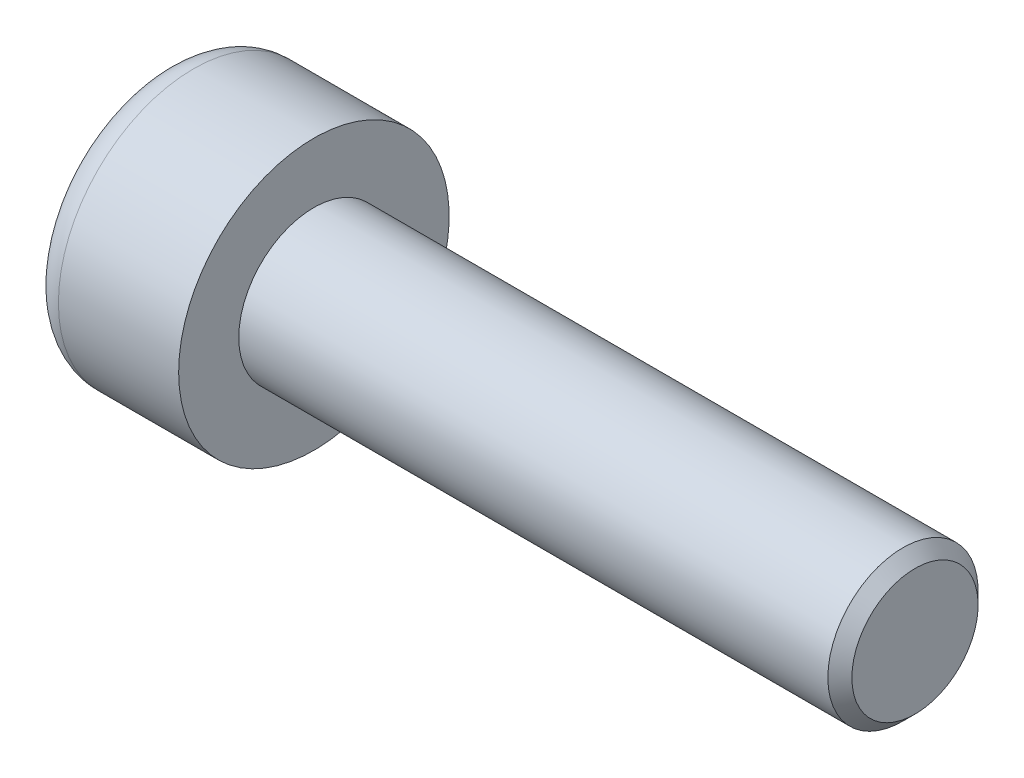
from build123d import *

# Parameters (mm, degrees)
CHANFREIN1_SIZE         = 0.2
CONG_1_R                = 0.5
EMPREINTE_POUR_CL_DEPTH = 2.5


with BuildPart() as part:
    # Esquisse1 → Base-R_volution (revolve)
    with BuildSketch(Plane.XY, mode=Mode.PRIVATE) as base_r_volution_sk:
        Polygon((-2.5, 0), (-2.5, 2.25), (0, 2.25), (0, 1.25), (10, 1.25), (10, 0), align=None)
    revolve(base_r_volution_sk.sketch.rotate(Axis((-28.982684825, 0, 0), (1, 0, 0)), 90), axis=Axis((-28.982684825, 0, 0), (1, 0, 0)))

    # Chanfrein1
    chanfrein1_edges = [part.edges().sort_by_distance(p)[0] for p in [
        (10, 0, -1.25),
    ]]
    chamfer(chanfrein1_edges, length=CHANFREIN1_SIZE)

    # Cong_1
    cong_1_edges = [part.edges().sort_by_distance(p)[0] for p in [
        (-2.5, 0, -2.25),
    ]]
    fillet(cong_1_edges, radius=CONG_1_R)

    # Esquisse2 → Empreinte pour cl (cut)
    with BuildSketch(Plane.ZY.offset(2.5)):
        Polygon((0.577350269, -1), (-0.577350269, -1), (-1.154700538, 0), (-0.577350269, 1), (0.577350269, 1), (1.154700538, 0), align=None)
    extrude(amount=-EMPREINTE_POUR_CL_DEPTH, mode=Mode.SUBTRACT)


solid = part.part
